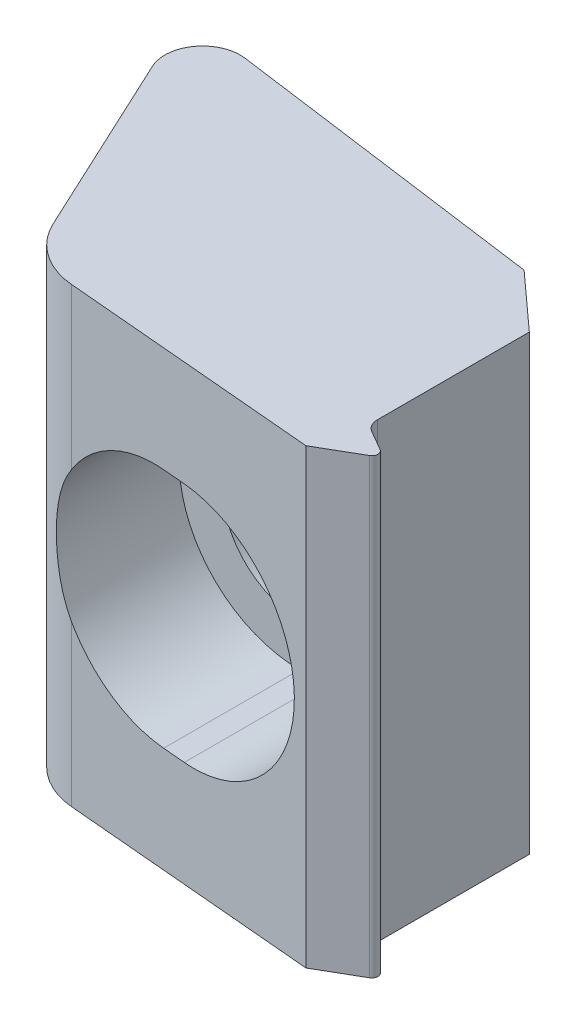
ISO-10303-21;
HEADER;
FILE_DESCRIPTION(('STEP AP214'),'2;1');
FILE_NAME('part.step','',(''),(''),'','','');
FILE_SCHEMA(('AUTOMOTIVE_DESIGN { 1 0 10303 214 1 1 1 1 }'));
ENDSEC;
DATA;
#1=APPLICATION_CONTEXT('core data for automotive mechanical design processes');
#2=APPLICATION_PROTOCOL_DEFINITION('international standard','automotive_design',2000,#1);
#3=PRODUCT_CONTEXT('',#1,'mechanical');
#4=PRODUCT('Part','Part','',(#3));
#5=PRODUCT_RELATED_PRODUCT_CATEGORY('part','',(#4));
#6=PRODUCT_DEFINITION_FORMATION('','',#4);
#7=PRODUCT_DEFINITION_CONTEXT('part definition',#1,'design');
#8=PRODUCT_DEFINITION('design','',#6,#7);
#9=PRODUCT_DEFINITION_SHAPE('','',#8);
#10=(LENGTH_UNIT() NAMED_UNIT(*) SI_UNIT(.MILLI.,.METRE.));
#11=(NAMED_UNIT(*) PLANE_ANGLE_UNIT() SI_UNIT($,.RADIAN.));
#12=(NAMED_UNIT(*) SI_UNIT($,.STERADIAN.) SOLID_ANGLE_UNIT());
#13=UNCERTAINTY_MEASURE_WITH_UNIT(LENGTH_MEASURE(1.E-05),#10,'distance_accuracy_value','');
#14=(GEOMETRIC_REPRESENTATION_CONTEXT(3) GLOBAL_UNCERTAINTY_ASSIGNED_CONTEXT((#13)) GLOBAL_UNIT_ASSIGNED_CONTEXT((#10,
#11,#12)) REPRESENTATION_CONTEXT('',''));
#15=CARTESIAN_POINT('',(0.,0.,0.));
#16=DIRECTION('',(0.,0.,1.));
#17=DIRECTION('',(1.,0.,0.));
#18=AXIS2_PLACEMENT_3D('',#15,#16,#17);
#19=CARTESIAN_POINT('',(14.6305142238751,19.05,23.7387920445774));
#20=DIRECTION('',(-0.50022485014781,0.,-0.865895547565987));
#21=DIRECTION('',(-0.865895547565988,0.,0.50022485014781));
#22=AXIS2_PLACEMENT_3D('',#19,#20,#21);
#23=PLANE('',#22);
#24=DIRECTION('',(0.865895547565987,0.,-0.50022485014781));
#25=VECTOR('',#24,1.);
#26=CARTESIAN_POINT('',(14.6305142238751,-19.05,23.7387920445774));
#27=LINE('',#26,#25);
#28=CARTESIAN_POINT('',(11.223932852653,-19.05,25.70676227));
#29=VERTEX_POINT('',#28);
#30=CARTESIAN_POINT('',(14.6305142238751,-19.05,23.7387920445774));
#31=VERTEX_POINT('',#30);
#32=EDGE_CURVE('E221',#29,#31,#27,.T.);
#33=ORIENTED_EDGE('',*,*,#32,.T.);
#34=DIRECTION('',(0.,-1.,0.));
#35=VECTOR('',#34,1.);
#36=CARTESIAN_POINT('',(14.6305142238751,19.05,23.7387920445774));
#37=LINE('',#36,#35);
#38=CARTESIAN_POINT('',(14.6305142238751,19.05,23.7387920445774));
#39=VERTEX_POINT('',#38);
#40=EDGE_CURVE('E276',#39,#31,#37,.T.);
#41=ORIENTED_EDGE('',*,*,#40,.F.);
#42=DIRECTION('',(0.865895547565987,0.,-0.50022485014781));
#43=VECTOR('',#42,1.);
#44=CARTESIAN_POINT('',(14.6305142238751,19.05,23.7387920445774));
#45=LINE('',#44,#43);
#46=CARTESIAN_POINT('',(11.223932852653,19.05,25.70676227));
#47=VERTEX_POINT('',#46);
#48=EDGE_CURVE('E303',#47,#39,#45,.T.);
#49=ORIENTED_EDGE('',*,*,#48,.F.);
#50=DIRECTION('',(0.,-1.,0.));
#51=VECTOR('',#50,1.);
#52=CARTESIAN_POINT('',(11.223932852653,19.05,25.70676227));
#53=LINE('',#52,#51);
#54=EDGE_CURVE('E278',#47,#29,#53,.T.);
#55=ORIENTED_EDGE('',*,*,#54,.T.);
#56=EDGE_LOOP('',(#33,#41,#49,#55));
#57=FACE_BOUND('',#56,.T.);
#58=ADVANCED_FACE('F14',(#57),#23,.F.);
#59=CARTESIAN_POINT('',(14.3764,19.05,23.2989171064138));
#60=DIRECTION('',(0.,-1.,0.));
#61=DIRECTION('',(1.,0.,0.));
#62=AXIS2_PLACEMENT_3D('',#59,#60,#61);
#63=CYLINDRICAL_SURFACE('',#62,0.508);
#64=CARTESIAN_POINT('',(14.3764,-19.05,23.2989171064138));
#65=DIRECTION('',(0.,1.,0.));
#66=DIRECTION('',(1.,0.,0.));
#67=AXIS2_PLACEMENT_3D('',#64,#65,#66);
#68=CIRCLE('',#67,0.508);
#69=CARTESIAN_POINT('',(14.6304493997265,-19.05,22.859004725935));
#70=VERTEX_POINT('',#69);
#71=EDGE_CURVE('E280',#31,#70,#68,.T.);
#72=ORIENTED_EDGE('',*,*,#71,.T.);
#73=DIRECTION('',(0.,-1.,0.));
#74=VECTOR('',#73,1.);
#75=CARTESIAN_POINT('',(14.6304493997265,19.05,22.859004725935));
#76=LINE('',#75,#74);
#77=CARTESIAN_POINT('',(14.6304493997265,19.05,22.859004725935));
#78=VERTEX_POINT('',#77);
#79=EDGE_CURVE('E352',#78,#70,#76,.T.);
#80=ORIENTED_EDGE('',*,*,#79,.F.);
#81=CARTESIAN_POINT('',(14.3764,19.05,23.2989171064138));
#82=DIRECTION('',(0.,1.,0.));
#83=DIRECTION('',(1.,0.,0.));
#84=AXIS2_PLACEMENT_3D('',#81,#82,#83);
#85=CIRCLE('',#84,0.508);
#86=EDGE_CURVE('E306',#39,#78,#85,.T.);
#87=ORIENTED_EDGE('',*,*,#86,.F.);
#88=ORIENTED_EDGE('',*,*,#40,.T.);
#89=EDGE_LOOP('',(#72,#80,#87,#88));
#90=FACE_BOUND('',#89,.T.);
#91=ADVANCED_FACE('F262',(#90),#63,.T.);
#92=CARTESIAN_POINT('',(12.9789493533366,19.05,21.9052634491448));
#93=DIRECTION('',(-0.500097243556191,0.,0.865969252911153));
#94=DIRECTION('',(0.865969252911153,0.,0.500097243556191));
#95=AXIS2_PLACEMENT_3D('',#92,#93,#94);
#96=PLANE('',#95);
#97=DIRECTION('',(-0.865969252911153,0.,-0.500097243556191));
#98=VECTOR('',#97,1.);
#99=CARTESIAN_POINT('',(12.9789493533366,-19.05,21.9052634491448));
#100=LINE('',#99,#98);
#101=CARTESIAN_POINT('',(12.9789493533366,-19.05,21.9052634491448));
#102=VERTEX_POINT('',#101);
#103=EDGE_CURVE('E281',#70,#102,#100,.T.);
#104=ORIENTED_EDGE('',*,*,#103,.T.);
#105=DIRECTION('',(0.,-1.,0.));
#106=VECTOR('',#105,1.);
#107=CARTESIAN_POINT('',(12.9789493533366,19.05,21.9052634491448));
#108=LINE('',#107,#106);
#109=CARTESIAN_POINT('',(12.9789493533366,19.05,21.9052634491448));
#110=VERTEX_POINT('',#109);
#111=EDGE_CURVE('E349',#110,#102,#108,.T.);
#112=ORIENTED_EDGE('',*,*,#111,.F.);
#113=DIRECTION('',(-0.865969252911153,0.,-0.500097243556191));
#114=VECTOR('',#113,1.);
#115=CARTESIAN_POINT('',(12.9789493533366,19.05,21.9052634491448));
#116=LINE('',#115,#114);
#117=EDGE_CURVE('E308',#78,#110,#116,.T.);
#118=ORIENTED_EDGE('',*,*,#117,.F.);
#119=ORIENTED_EDGE('',*,*,#79,.T.);
#120=EDGE_LOOP('',(#104,#112,#118,#119));
#121=FACE_BOUND('',#120,.T.);
#122=ADVANCED_FACE('F268',(#121),#96,.F.);
#123=CARTESIAN_POINT('',(13.614072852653,19.05,20.8054824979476));
#124=DIRECTION('',(0.,-1.,0.));
#125=DIRECTION('',(1.,0.,0.));
#126=AXIS2_PLACEMENT_3D('',#123,#124,#125);
#127=CYLINDRICAL_SURFACE('',#126,1.27);
#128=CARTESIAN_POINT('',(13.614072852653,-19.05,20.8054824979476));
#129=DIRECTION('',(0.,-1.,0.));
#130=DIRECTION('',(-1.,0.,0.));
#131=AXIS2_PLACEMENT_3D('',#128,#129,#130);
#132=CIRCLE('',#131,1.27);
#133=CARTESIAN_POINT('',(12.344072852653,-19.05,20.8054824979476));
#134=VERTEX_POINT('',#133);
#135=EDGE_CURVE('E284',#102,#134,#132,.T.);
#136=ORIENTED_EDGE('',*,*,#135,.T.);
#137=DIRECTION('',(0.,-1.,0.));
#138=VECTOR('',#137,1.);
#139=CARTESIAN_POINT('',(12.344072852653,19.05,20.8054824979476));
#140=LINE('',#139,#138);
#141=CARTESIAN_POINT('',(12.344072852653,19.05,20.8054824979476));
#142=VERTEX_POINT('',#141);
#143=EDGE_CURVE('E346',#142,#134,#140,.T.);
#144=ORIENTED_EDGE('',*,*,#143,.F.);
#145=CARTESIAN_POINT('',(13.614072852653,19.05,20.8054824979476));
#146=DIRECTION('',(0.,-1.,0.));
#147=DIRECTION('',(-1.,0.,0.));
#148=AXIS2_PLACEMENT_3D('',#145,#146,#147);
#149=CIRCLE('',#148,1.27);
#150=EDGE_CURVE('E310',#110,#142,#149,.T.);
#151=ORIENTED_EDGE('',*,*,#150,.F.);
#152=ORIENTED_EDGE('',*,*,#111,.T.);
#153=EDGE_LOOP('',(#136,#144,#151,#152));
#154=FACE_BOUND('',#153,.T.);
#155=ADVANCED_FACE('F399',(#154),#127,.F.);
#156=CARTESIAN_POINT('',(12.344072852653,19.05,8.00550227));
#157=DIRECTION('',(-1.,0.,0.));
#158=DIRECTION('',(0.,-1.,0.));
#159=AXIS2_PLACEMENT_3D('',#156,#157,#158);
#160=PLANE('',#159);
#161=DIRECTION('',(0.,0.,-1.));
#162=VECTOR('',#161,1.);
#163=CARTESIAN_POINT('',(12.344072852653,-19.05,8.00550227));
#164=LINE('',#163,#162);
#165=CARTESIAN_POINT('',(12.344072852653,-19.05,8.00550227));
#166=VERTEX_POINT('',#165);
#167=EDGE_CURVE('E288',#134,#166,#164,.T.);
#168=ORIENTED_EDGE('',*,*,#167,.T.);
#169=DIRECTION('',(0.,-1.,0.));
#170=VECTOR('',#169,1.);
#171=CARTESIAN_POINT('',(12.344072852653,19.05,8.00550227));
#172=LINE('',#171,#170);
#173=CARTESIAN_POINT('',(12.344072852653,19.05,8.00550227));
#174=VERTEX_POINT('',#173);
#175=EDGE_CURVE('E343',#174,#166,#172,.T.);
#176=ORIENTED_EDGE('',*,*,#175,.F.);
#177=DIRECTION('',(0.,0.,-1.));
#178=VECTOR('',#177,1.);
#179=CARTESIAN_POINT('',(12.344072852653,19.05,8.00550227));
#180=LINE('',#179,#178);
#181=EDGE_CURVE('E312',#142,#174,#180,.T.);
#182=ORIENTED_EDGE('',*,*,#181,.F.);
#183=ORIENTED_EDGE('',*,*,#143,.T.);
#184=EDGE_LOOP('',(#168,#176,#182,#183));
#185=FACE_BOUND('',#184,.T.);
#186=ADVANCED_FACE('F395',(#185),#160,.F.);
#187=CARTESIAN_POINT('',(7.604432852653,19.05,3.70782227));
#188=DIRECTION('',(-0.671723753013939,0.,0.740801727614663));
#189=DIRECTION('',(0.740801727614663,0.,0.671723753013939));
#190=AXIS2_PLACEMENT_3D('',#187,#188,#189);
#191=PLANE('',#190);
#192=DIRECTION('',(-0.740801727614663,0.,-0.671723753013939));
#193=VECTOR('',#192,1.);
#194=CARTESIAN_POINT('',(7.604432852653,-19.05,3.70782227));
#195=LINE('',#194,#193);
#196=CARTESIAN_POINT('',(7.604432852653,-19.05,3.70782227));
#197=VERTEX_POINT('',#196);
#198=EDGE_CURVE('E290',#166,#197,#195,.T.);
#199=ORIENTED_EDGE('',*,*,#198,.T.);
#200=DIRECTION('',(0.,-1.,0.));
#201=VECTOR('',#200,1.);
#202=CARTESIAN_POINT('',(7.604432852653,19.05,3.70782227));
#203=LINE('',#202,#201);
#204=CARTESIAN_POINT('',(7.604432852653,19.05,3.70782227));
#205=VERTEX_POINT('',#204);
#206=EDGE_CURVE('E340',#205,#197,#203,.T.);
#207=ORIENTED_EDGE('',*,*,#206,.F.);
#208=DIRECTION('',(-0.740801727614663,0.,-0.671723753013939));
#209=VECTOR('',#208,1.);
#210=CARTESIAN_POINT('',(7.604432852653,19.05,3.70782227));
#211=LINE('',#210,#209);
#212=EDGE_CURVE('E314',#174,#205,#211,.T.);
#213=ORIENTED_EDGE('',*,*,#212,.F.);
#214=ORIENTED_EDGE('',*,*,#175,.T.);
#215=EDGE_LOOP('',(#199,#207,#213,#214));
#216=FACE_BOUND('',#215,.T.);
#217=ADVANCED_FACE('F390',(#216),#191,.F.);
#218=CARTESIAN_POINT('',(-19.612114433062,19.05,2.11940187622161E-09));
#219=DIRECTION('',(-0.134987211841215,0.,0.990847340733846));
#220=DIRECTION('',(0.990847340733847,0.,0.134987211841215));
#221=AXIS2_PLACEMENT_3D('',#218,#219,#220);
#222=PLANE('',#221);
#223=DIRECTION('',(0.990847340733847,0.,0.134987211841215));
#224=VECTOR('',#223,1.);
#225=CARTESIAN_POINT('',(-19.612114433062,-6.5405,2.11940187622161E-09));
#226=LINE('',#225,#224);
#227=CARTESIAN_POINT('',(-1.905,-6.5405,2.4123130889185));
#228=VERTEX_POINT('',#227);
#229=CARTESIAN_POINT('',(0.,-6.5405,2.67183908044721));
#230=VERTEX_POINT('',#229);
#231=EDGE_CURVE('E183',#228,#230,#226,.T.);
#232=ORIENTED_EDGE('',*,*,#231,.T.);
#233=CARTESIAN_POINT('',(0.,0.,2.67183908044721));
#234=DIRECTION('',(-0.134987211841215,0.,0.990847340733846));
#235=DIRECTION('',(0.990847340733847,0.,0.134987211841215));
#236=AXIS2_PLACEMENT_3D('',#233,#234,#235);
#237=ELLIPSE('',#236,6.60091593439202,6.5405);
#238=CARTESIAN_POINT('',(0.,6.5405,2.67183908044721));
#239=VERTEX_POINT('',#238);
#240=EDGE_CURVE('E186',#230,#239,#237,.T.);
#241=ORIENTED_EDGE('',*,*,#240,.T.);
#242=DIRECTION('',(-0.990847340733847,0.,-0.134987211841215));
#243=VECTOR('',#242,1.);
#244=CARTESIAN_POINT('',(-19.612114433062,6.5405,2.11940187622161E-09));
#245=LINE('',#244,#243);
#246=CARTESIAN_POINT('',(-1.905,6.5405,2.4123130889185));
#247=VERTEX_POINT('',#246);
#248=EDGE_CURVE('E178',#239,#247,#245,.T.);
#249=ORIENTED_EDGE('',*,*,#248,.T.);
#250=CARTESIAN_POINT('',(-1.905,0.,2.4123130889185));
#251=DIRECTION('',(-0.134987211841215,0.,0.990847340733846));
#252=DIRECTION('',(0.990847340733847,0.,0.134987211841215));
#253=AXIS2_PLACEMENT_3D('',#250,#251,#252);
#254=ELLIPSE('',#253,6.60091593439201,6.5405);
#255=EDGE_CURVE('E158',#247,#228,#254,.T.);
#256=ORIENTED_EDGE('',*,*,#255,.T.);
#257=EDGE_LOOP('',(#232,#241,#249,#256));
#258=FACE_BOUND('',#257,.T.);
#259=DIRECTION('',(-0.990847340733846,0.,-0.134987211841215));
#260=VECTOR('',#259,1.);
#261=CARTESIAN_POINT('',(-19.612114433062,-19.05,2.11940187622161E-09));
#262=LINE('',#261,#260);
#263=CARTESIAN_POINT('',(-19.612114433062,-19.05,2.11940187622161E-09));
#264=VERTEX_POINT('',#263);
#265=EDGE_CURVE('E292',#197,#264,#262,.T.);
#266=ORIENTED_EDGE('',*,*,#265,.T.);
#267=DIRECTION('',(0.,-1.,0.));
#268=VECTOR('',#267,1.);
#269=CARTESIAN_POINT('',(-19.612114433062,19.05,2.11940187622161E-09));
#270=LINE('',#269,#268);
#271=CARTESIAN_POINT('',(-19.612114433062,19.05,2.11940187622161E-09));
#272=VERTEX_POINT('',#271);
#273=EDGE_CURVE('E337',#272,#264,#270,.T.);
#274=ORIENTED_EDGE('',*,*,#273,.F.);
#275=DIRECTION('',(-0.990847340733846,0.,-0.134987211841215));
#276=VECTOR('',#275,1.);
#277=CARTESIAN_POINT('',(-19.612114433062,19.05,2.11940187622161E-09));
#278=LINE('',#277,#276);
#279=EDGE_CURVE('E316',#205,#272,#278,.T.);
#280=ORIENTED_EDGE('',*,*,#279,.F.);
#281=ORIENTED_EDGE('',*,*,#206,.T.);
#282=EDGE_LOOP('',(#266,#274,#280,#281));
#283=FACE_BOUND('',#282,.T.);
#284=ADVANCED_FACE('F384',(#258,#283),#222,.F.);
#285=CARTESIAN_POINT('',(-20.0406988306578,19.05,3.14594030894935));
#286=DIRECTION('',(0.,-1.,0.));
#287=DIRECTION('',(1.,0.,0.));
#288=AXIS2_PLACEMENT_3D('',#285,#286,#287);
#289=CYLINDRICAL_SURFACE('',#288,3.175);
#290=CARTESIAN_POINT('',(-20.0406988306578,-19.05,3.14594030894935));
#291=DIRECTION('',(0.,1.,0.));
#292=DIRECTION('',(1.,0.,0.));
#293=AXIS2_PLACEMENT_3D('',#290,#291,#292);
#294=CIRCLE('',#293,3.175);
#295=CARTESIAN_POINT('',(-22.918160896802,-19.05,4.4878930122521));
#296=VERTEX_POINT('',#295);
#297=EDGE_CURVE('E294',#264,#296,#294,.T.);
#298=ORIENTED_EDGE('',*,*,#297,.T.);
#299=DIRECTION('',(0.,-1.,0.));
#300=VECTOR('',#299,1.);
#301=CARTESIAN_POINT('',(-22.918160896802,19.05,4.4878930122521));
#302=LINE('',#301,#300);
#303=CARTESIAN_POINT('',(-22.918160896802,19.05,4.4878930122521));
#304=VERTEX_POINT('',#303);
#305=EDGE_CURVE('E334',#304,#296,#302,.T.);
#306=ORIENTED_EDGE('',*,*,#305,.F.);
#307=CARTESIAN_POINT('',(-20.0406988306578,19.05,3.14594030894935));
#308=DIRECTION('',(0.,1.,0.));
#309=DIRECTION('',(1.,0.,0.));
#310=AXIS2_PLACEMENT_3D('',#307,#308,#309);
#311=CIRCLE('',#310,3.175);
#312=EDGE_CURVE('E318',#272,#304,#311,.T.);
#313=ORIENTED_EDGE('',*,*,#312,.F.);
#314=ORIENTED_EDGE('',*,*,#273,.T.);
#315=EDGE_LOOP('',(#298,#306,#313,#314));
#316=FACE_BOUND('',#315,.T.);
#317=ADVANCED_FACE('F380',(#316),#289,.T.);
#318=CARTESIAN_POINT('',(-15.6035579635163,19.05,20.1721212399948));
#319=DIRECTION('',(0.906287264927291,0.,-0.422662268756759));
#320=DIRECTION('',(-0.422662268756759,0.,-0.906287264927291));
#321=AXIS2_PLACEMENT_3D('',#318,#319,#320);
#322=PLANE('',#321);
#323=DIRECTION('',(0.422662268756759,0.,0.906287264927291));
#324=VECTOR('',#323,1.);
#325=CARTESIAN_POINT('',(-15.6035579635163,-19.05,20.1721212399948));
#326=LINE('',#325,#324);
#327=CARTESIAN_POINT('',(-15.6035579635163,-19.05,20.1721212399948));
#328=VERTEX_POINT('',#327);
#329=EDGE_CURVE('E296',#296,#328,#326,.T.);
#330=ORIENTED_EDGE('',*,*,#329,.T.);
#331=DIRECTION('',(0.,-1.,0.));
#332=VECTOR('',#331,1.);
#333=CARTESIAN_POINT('',(-15.6035579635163,19.05,20.1721212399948));
#334=LINE('',#333,#332);
#335=CARTESIAN_POINT('',(-15.6035579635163,19.05,20.1721212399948));
#336=VERTEX_POINT('',#335);
#337=EDGE_CURVE('E331',#336,#328,#334,.T.);
#338=ORIENTED_EDGE('',*,*,#337,.F.);
#339=DIRECTION('',(0.422662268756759,0.,0.906287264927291));
#340=VECTOR('',#339,1.);
#341=CARTESIAN_POINT('',(-15.6035579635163,19.05,20.1721212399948));
#342=LINE('',#341,#340);
#343=EDGE_CURVE('E320',#304,#336,#342,.T.);
#344=ORIENTED_EDGE('',*,*,#343,.F.);
#345=ORIENTED_EDGE('',*,*,#305,.T.);
#346=EDGE_LOOP('',(#330,#338,#344,#345));
#347=FACE_BOUND('',#346,.T.);
#348=ADVANCED_FACE('F258',(#347),#322,.F.);
#349=CARTESIAN_POINT('',(-9.84863383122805,19.05,17.4882158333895));
#350=DIRECTION('',(0.,-1.,0.));
#351=DIRECTION('',(1.,0.,0.));
#352=AXIS2_PLACEMENT_3D('',#349,#350,#351);
#353=CYLINDRICAL_SURFACE('',#352,6.35);
#354=DIRECTION('',(0.,-1.,0.));
#355=VECTOR('',#354,1.);
#356=CARTESIAN_POINT('',(-10.402270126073,19.05,23.814034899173));
#357=LINE('',#356,#355);
#358=CARTESIAN_POINT('',(-10.402270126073,-5.56973970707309,23.814034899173));
#359=VERTEX_POINT('',#358);
#360=CARTESIAN_POINT('',(-10.402270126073,-19.05,23.814034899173));
#361=VERTEX_POINT('',#360);
#362=EDGE_CURVE('E327',#359,#361,#357,.T.);
#363=ORIENTED_EDGE('',*,*,#362,.F.);
#364=CARTESIAN_POINT('',(-10.402270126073,-5.56973970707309,23.814034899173));
#365=CARTESIAN_POINT('',(-10.4759075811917,-5.45739721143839,23.8075876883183));
#366=CARTESIAN_POINT('',(-10.5472768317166,-5.34365579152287,23.8000485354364));
#367=CARTESIAN_POINT('',(-10.6853939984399,-5.11353987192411,23.783227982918));
#368=CARTESIAN_POINT('',(-10.7521423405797,-4.99716561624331,23.7739467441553));
#369=CARTESIAN_POINT('',(-10.9452888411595,-4.64441798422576,23.7441592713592));
#370=CARTESIAN_POINT('',(-11.0646567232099,-4.40431555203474,23.7217025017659));
#371=CARTESIAN_POINT('',(-11.2842510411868,-3.91501732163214,23.6748259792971));
#372=CARTESIAN_POINT('',(-11.3844291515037,-3.66580040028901,23.6504014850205));
#373=CARTESIAN_POINT('',(-11.5647863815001,-3.16009359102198,23.6026272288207));
#374=CARTESIAN_POINT('',(-11.6449634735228,-2.90360296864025,23.579277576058));
#375=CARTESIAN_POINT('',(-11.7888391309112,-2.3698218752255,23.5350421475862));
#376=CARTESIAN_POINT('',(-11.8513228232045,-2.09218420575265,23.514375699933));
#377=CARTESIAN_POINT('',(-11.952826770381,-1.53223050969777,23.4796897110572));
#378=CARTESIAN_POINT('',(-11.99184723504,-1.24991452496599,23.4656701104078));
#379=CARTESIAN_POINT('',(-12.0459916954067,-0.683200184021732,23.4459800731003));
#380=CARTESIAN_POINT('',(-12.0611575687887,-0.398806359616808,23.4402950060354));
#381=CARTESIAN_POINT('',(-12.0675573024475,0.170276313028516,23.4379128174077));
#382=CARTESIAN_POINT('',(-12.0587925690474,0.454965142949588,23.4412151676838));
#383=CARTESIAN_POINT('',(-12.0183134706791,1.01028503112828,23.4560813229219));
#384=CARTESIAN_POINT('',(-11.9875911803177,1.28099894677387,23.4672877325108));
#385=CARTESIAN_POINT('',(-11.904589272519,1.81874753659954,23.4963332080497));
#386=CARTESIAN_POINT('',(-11.8523081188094,2.08578194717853,23.5141727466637));
#387=CARTESIAN_POINT('',(-11.7265644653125,2.61465173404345,23.5545351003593));
#388=CARTESIAN_POINT('',(-11.6530866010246,2.87648319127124,23.5770613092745));
#389=CARTESIAN_POINT('',(-11.4854941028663,3.39315539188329,23.6242370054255));
#390=CARTESIAN_POINT('',(-11.3913844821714,3.6479978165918,23.6488859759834));
#391=CARTESIAN_POINT('',(-11.1660528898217,4.19023690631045,23.7012975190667));
#392=CARTESIAN_POINT('',(-11.0312848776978,4.47619138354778,23.7289148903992));
#393=CARTESIAN_POINT('',(-10.8096751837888,4.89460986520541,23.7655139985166));
#394=CARTESIAN_POINT('',(-10.7326759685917,5.03215702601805,23.7768974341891));
#395=CARTESIAN_POINT('',(-10.5722554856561,5.30369191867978,23.7973680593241));
#396=CARTESIAN_POINT('',(-10.4888320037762,5.43767840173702,23.8064544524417));
#397=CARTESIAN_POINT('',(-10.402270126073,5.5697397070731,23.814034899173));
#398=B_SPLINE_CURVE_WITH_KNOTS('',3,(#364,#365,#366,#367,#368,#369,#370,#371,#372,#373,#374,
#375,#376,#377,#378,#379,#380,#381,#382,#383,#384,#385,#386,#387,#388,#389,#390,#391,#392,#393,
#394,#395,#396,#397),.UNSPECIFIED.,.F.,.F.,(4,2,2,2,2,2,2,2,2,2,2,2,2,2,2,2,4),(0.,
0.403371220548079,0.806705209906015,1.61300011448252,2.42129956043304,3.22968091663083,
4.08461565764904,4.93954275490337,5.79296731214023,6.64634171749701,7.46341587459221,
8.28054826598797,9.09827445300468,9.91580216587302,10.8662239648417,11.340193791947,
11.8143277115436),.UNSPECIFIED.);
#399=CARTESIAN_POINT('',(-10.402270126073,5.56973970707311,23.814034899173));
#400=VERTEX_POINT('',#399);
#401=EDGE_CURVE('E205',#359,#400,#398,.T.);
#402=ORIENTED_EDGE('',*,*,#401,.T.);
#403=CARTESIAN_POINT('',(-10.402270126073,19.05,23.814034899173));
#404=VERTEX_POINT('',#403);
#405=EDGE_CURVE('E328',#404,#400,#357,.T.);
#406=ORIENTED_EDGE('',*,*,#405,.F.);
#407=CARTESIAN_POINT('',(-9.84863383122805,19.05,17.4882158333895));
#408=DIRECTION('',(0.,1.,0.));
#409=DIRECTION('',(1.,0.,0.));
#410=AXIS2_PLACEMENT_3D('',#407,#408,#409);
#411=CIRCLE('',#410,6.35);
#412=EDGE_CURVE('E322',#336,#404,#411,.T.);
#413=ORIENTED_EDGE('',*,*,#412,.F.);
#414=ORIENTED_EDGE('',*,*,#337,.T.);
#415=CARTESIAN_POINT('',(-9.84863383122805,-19.05,17.4882158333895));
#416=DIRECTION('',(0.,1.,0.));
#417=DIRECTION('',(1.,0.,0.));
#418=AXIS2_PLACEMENT_3D('',#415,#416,#417);
#419=CIRCLE('',#418,6.35);
#420=EDGE_CURVE('E298',#328,#361,#419,.T.);
#421=ORIENTED_EDGE('',*,*,#420,.T.);
#422=EDGE_LOOP('',(#363,#402,#406,#413,#414,#421));
#423=FACE_BOUND('',#422,.T.);
#424=ADVANCED_FACE('F223',(#423),#353,.T.);
#425=CARTESIAN_POINT('',(11.223932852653,19.05,25.70676227));
#426=DIRECTION('',(0.0871868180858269,0.,-0.996191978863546));
#427=DIRECTION('',(-0.996191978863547,0.,-0.0871868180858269));
#428=AXIS2_PLACEMENT_3D('',#425,#426,#427);
#429=PLANE('',#428);
#430=DIRECTION('',(-0.996191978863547,0.,-0.0871868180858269));
#431=VECTOR('',#430,1.);
#432=CARTESIAN_POINT('',(11.2239328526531,-10.16,25.70676227));
#433=LINE('',#432,#431);
#434=CARTESIAN_POINT('',(0.,-10.16,24.7244425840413));
#435=VERTEX_POINT('',#434);
#436=CARTESIAN_POINT('',(-1.905,-10.16,24.5577168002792));
#437=VERTEX_POINT('',#436);
#438=EDGE_CURVE('E17',#435,#437,#433,.T.);
#439=ORIENTED_EDGE('',*,*,#438,.T.);
#440=CARTESIAN_POINT('',(-1.905,0.,24.5577168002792));
#441=DIRECTION('',(0.0871868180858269,0.,-0.996191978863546));
#442=DIRECTION('',(0.996191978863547,0.,0.0871868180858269));
#443=AXIS2_PLACEMENT_3D('',#440,#441,#442);
#444=ELLIPSE('',#443,10.1988373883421,10.16);
#445=EDGE_CURVE('E9',#437,#359,#444,.T.);
#446=ORIENTED_EDGE('',*,*,#445,.T.);
#447=ORIENTED_EDGE('',*,*,#362,.T.);
#448=DIRECTION('',(0.996191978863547,0.,0.0871868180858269));
#449=VECTOR('',#448,1.);
#450=CARTESIAN_POINT('',(11.223932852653,-19.05,25.70676227));
#451=LINE('',#450,#449);
#452=EDGE_CURVE('E301',#361,#29,#451,.T.);
#453=ORIENTED_EDGE('',*,*,#452,.T.);
#454=ORIENTED_EDGE('',*,*,#54,.F.);
#455=DIRECTION('',(0.996191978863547,0.,0.0871868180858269));
#456=VECTOR('',#455,1.);
#457=CARTESIAN_POINT('',(11.223932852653,19.05,25.70676227));
#458=LINE('',#457,#456);
#459=EDGE_CURVE('E324',#404,#47,#458,.T.);
#460=ORIENTED_EDGE('',*,*,#459,.F.);
#461=ORIENTED_EDGE('',*,*,#405,.T.);
#462=CARTESIAN_POINT('',(-1.905,10.16,24.5577168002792));
#463=VERTEX_POINT('',#462);
#464=EDGE_CURVE('E23',#400,#463,#444,.T.);
#465=ORIENTED_EDGE('',*,*,#464,.T.);
#466=DIRECTION('',(0.996191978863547,0.,0.0871868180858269));
#467=VECTOR('',#466,1.);
#468=CARTESIAN_POINT('',(11.223932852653,10.16,25.70676227));
#469=LINE('',#468,#467);
#470=CARTESIAN_POINT('',(0.,10.16,24.7244425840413));
#471=VERTEX_POINT('',#470);
#472=EDGE_CURVE('E355',#463,#471,#469,.T.);
#473=ORIENTED_EDGE('',*,*,#472,.T.);
#474=CARTESIAN_POINT('',(0.,0.,24.7244425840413));
#475=DIRECTION('',(0.0871868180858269,0.,-0.996191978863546));
#476=DIRECTION('',(0.996191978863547,0.,0.0871868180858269));
#477=AXIS2_PLACEMENT_3D('',#474,#475,#476);
#478=ELLIPSE('',#477,10.1988373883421,10.16);
#479=EDGE_CURVE('E358',#471,#435,#478,.T.);
#480=ORIENTED_EDGE('',*,*,#479,.T.);
#481=EDGE_LOOP('',(#439,#446,#447,#453,#454,#460,#461,#465,#473,#480));
#482=FACE_BOUND('',#481,.T.);
#483=ADVANCED_FACE('F249',(#482),#429,.F.);
#484=CARTESIAN_POINT('',(-9.84863383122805,19.05,17.4882158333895));
#485=DIRECTION('',(0.,-1.,0.));
#486=DIRECTION('',(1.,0.,0.));
#487=AXIS2_PLACEMENT_3D('',#484,#485,#486);
#488=PLANE('',#487);
#489=ORIENTED_EDGE('',*,*,#48,.T.);
#490=ORIENTED_EDGE('',*,*,#86,.T.);
#491=ORIENTED_EDGE('',*,*,#117,.T.);
#492=ORIENTED_EDGE('',*,*,#150,.T.);
#493=ORIENTED_EDGE('',*,*,#181,.T.);
#494=ORIENTED_EDGE('',*,*,#212,.T.);
#495=ORIENTED_EDGE('',*,*,#279,.T.);
#496=ORIENTED_EDGE('',*,*,#312,.T.);
#497=ORIENTED_EDGE('',*,*,#343,.T.);
#498=ORIENTED_EDGE('',*,*,#412,.T.);
#499=ORIENTED_EDGE('',*,*,#459,.T.);
#500=EDGE_LOOP('',(#489,#490,#491,#492,#493,#494,#495,#496,#497,#498,#499));
#501=FACE_BOUND('',#500,.T.);
#502=ADVANCED_FACE('F246',(#501),#488,.F.);
#503=CARTESIAN_POINT('',(-9.84863383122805,-19.05,17.4882158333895));
#504=DIRECTION('',(0.,-1.,0.));
#505=DIRECTION('',(1.,0.,0.));
#506=AXIS2_PLACEMENT_3D('',#503,#504,#505);
#507=PLANE('',#506);
#508=ORIENTED_EDGE('',*,*,#32,.F.);
#509=ORIENTED_EDGE('',*,*,#452,.F.);
#510=ORIENTED_EDGE('',*,*,#420,.F.);
#511=ORIENTED_EDGE('',*,*,#329,.F.);
#512=ORIENTED_EDGE('',*,*,#297,.F.);
#513=ORIENTED_EDGE('',*,*,#265,.F.);
#514=ORIENTED_EDGE('',*,*,#198,.F.);
#515=ORIENTED_EDGE('',*,*,#167,.F.);
#516=ORIENTED_EDGE('',*,*,#135,.F.);
#517=ORIENTED_EDGE('',*,*,#103,.F.);
#518=ORIENTED_EDGE('',*,*,#71,.F.);
#519=EDGE_LOOP('',(#508,#509,#510,#511,#512,#513,#514,#515,#516,#517,#518));
#520=FACE_BOUND('',#519,.T.);
#521=ADVANCED_FACE('F242',(#520),#507,.T.);
#522=CARTESIAN_POINT('',(0.,0.,13.10074227));
#523=DIRECTION('',(0.,0.,1.));
#524=DIRECTION('',(0.,1.,0.));
#525=AXIS2_PLACEMENT_3D('',#522,#523,#524);
#526=CYLINDRICAL_SURFACE('',#525,10.16);
#527=DIRECTION('',(0.,0.,1.));
#528=VECTOR('',#527,1.);
#529=CARTESIAN_POINT('',(0.,10.16,13.10074227));
#530=LINE('',#529,#528);
#531=CARTESIAN_POINT('',(0.,10.16,13.10074227));
#532=VERTEX_POINT('',#531);
#533=EDGE_CURVE('E201',#532,#471,#530,.T.);
#534=ORIENTED_EDGE('',*,*,#533,.F.);
#535=CARTESIAN_POINT('',(0.,0.,13.10074227));
#536=DIRECTION('',(0.,0.,1.));
#537=DIRECTION('',(0.,1.,0.));
#538=AXIS2_PLACEMENT_3D('',#535,#536,#537);
#539=CIRCLE('',#538,10.16);
#540=CARTESIAN_POINT('',(0.,-10.16,13.10074227));
#541=VERTEX_POINT('',#540);
#542=EDGE_CURVE('E189',#541,#532,#539,.T.);
#543=ORIENTED_EDGE('',*,*,#542,.F.);
#544=DIRECTION('',(0.,0.,1.));
#545=VECTOR('',#544,1.);
#546=CARTESIAN_POINT('',(0.,-10.16,13.10074227));
#547=LINE('',#546,#545);
#548=EDGE_CURVE('E202',#541,#435,#547,.T.);
#549=ORIENTED_EDGE('',*,*,#548,.T.);
#550=ORIENTED_EDGE('',*,*,#479,.F.);
#551=EDGE_LOOP('',(#534,#543,#549,#550));
#552=FACE_BOUND('',#551,.T.);
#553=ADVANCED_FACE('F239',(#552),#526,.F.);
#554=CARTESIAN_POINT('',(0.,-10.16,13.10074227));
#555=DIRECTION('',(0.,-1.,0.));
#556=DIRECTION('',(1.,0.,0.));
#557=AXIS2_PLACEMENT_3D('',#554,#555,#556);
#558=PLANE('',#557);
#559=ORIENTED_EDGE('',*,*,#548,.F.);
#560=DIRECTION('',(1.,0.,0.));
#561=VECTOR('',#560,1.);
#562=CARTESIAN_POINT('',(0.,-10.16,13.10074227));
#563=LINE('',#562,#561);
#564=CARTESIAN_POINT('',(-1.905,-10.16,13.10074227));
#565=VERTEX_POINT('',#564);
#566=EDGE_CURVE('E198',#565,#541,#563,.T.);
#567=ORIENTED_EDGE('',*,*,#566,.F.);
#568=DIRECTION('',(0.,0.,1.));
#569=VECTOR('',#568,1.);
#570=CARTESIAN_POINT('',(-1.905,-10.16,13.10074227));
#571=LINE('',#570,#569);
#572=EDGE_CURVE('E206',#565,#437,#571,.T.);
#573=ORIENTED_EDGE('',*,*,#572,.T.);
#574=ORIENTED_EDGE('',*,*,#438,.F.);
#575=EDGE_LOOP('',(#559,#567,#573,#574));
#576=FACE_BOUND('',#575,.T.);
#577=ADVANCED_FACE('F233',(#576),#558,.F.);
#578=CARTESIAN_POINT('',(-1.905,0.,13.10074227));
#579=DIRECTION('',(0.,0.,1.));
#580=DIRECTION('',(0.,1.,0.));
#581=AXIS2_PLACEMENT_3D('',#578,#579,#580);
#582=CYLINDRICAL_SURFACE('',#581,10.16);
#583=ORIENTED_EDGE('',*,*,#572,.F.);
#584=CARTESIAN_POINT('',(-1.905,0.,13.10074227));
#585=DIRECTION('',(0.,0.,1.));
#586=DIRECTION('',(0.,1.,0.));
#587=AXIS2_PLACEMENT_3D('',#584,#585,#586);
#588=CIRCLE('',#587,10.16);
#589=CARTESIAN_POINT('',(-1.905,10.16,13.10074227));
#590=VERTEX_POINT('',#589);
#591=EDGE_CURVE('E195',#590,#565,#588,.T.);
#592=ORIENTED_EDGE('',*,*,#591,.F.);
#593=DIRECTION('',(0.,0.,1.));
#594=VECTOR('',#593,1.);
#595=CARTESIAN_POINT('',(-1.905,10.16,13.10074227));
#596=LINE('',#595,#594);
#597=EDGE_CURVE('E209',#590,#463,#596,.T.);
#598=ORIENTED_EDGE('',*,*,#597,.T.);
#599=ORIENTED_EDGE('',*,*,#464,.F.);
#600=ORIENTED_EDGE('',*,*,#401,.F.);
#601=ORIENTED_EDGE('',*,*,#445,.F.);
#602=EDGE_LOOP('',(#583,#592,#598,#599,#600,#601));
#603=FACE_BOUND('',#602,.T.);
#604=ADVANCED_FACE('F227',(#603),#582,.F.);
#605=CARTESIAN_POINT('',(-1.905,10.16,13.10074227));
#606=DIRECTION('',(0.,1.,0.));
#607=DIRECTION('',(-1.,0.,0.));
#608=AXIS2_PLACEMENT_3D('',#605,#606,#607);
#609=PLANE('',#608);
#610=ORIENTED_EDGE('',*,*,#597,.F.);
#611=DIRECTION('',(-1.,0.,0.));
#612=VECTOR('',#611,1.);
#613=CARTESIAN_POINT('',(-1.905,10.16,13.10074227));
#614=LINE('',#613,#612);
#615=EDGE_CURVE('E192',#532,#590,#614,.T.);
#616=ORIENTED_EDGE('',*,*,#615,.F.);
#617=ORIENTED_EDGE('',*,*,#533,.T.);
#618=ORIENTED_EDGE('',*,*,#472,.F.);
#619=EDGE_LOOP('',(#610,#616,#617,#618));
#620=FACE_BOUND('',#619,.T.);
#621=ADVANCED_FACE('F232',(#620),#609,.F.);
#622=CARTESIAN_POINT('',(0.,0.,13.10074227));
#623=DIRECTION('',(0.,0.,1.));
#624=DIRECTION('',(0.,1.,0.));
#625=AXIS2_PLACEMENT_3D('',#622,#623,#624);
#626=PLANE('',#625);
#627=CARTESIAN_POINT('',(0.,0.,13.10074227));
#628=DIRECTION('',(0.,0.,1.));
#629=DIRECTION('',(0.,1.,0.));
#630=AXIS2_PLACEMENT_3D('',#627,#628,#629);
#631=CIRCLE('',#630,6.5405);
#632=CARTESIAN_POINT('',(0.,-6.5405,13.10074227));
#633=VERTEX_POINT('',#632);
#634=CARTESIAN_POINT('',(0.,6.5405,13.10074227));
#635=VERTEX_POINT('',#634);
#636=EDGE_CURVE('E38',#633,#635,#631,.T.);
#637=ORIENTED_EDGE('',*,*,#636,.F.);
#638=DIRECTION('',(1.,0.,0.));
#639=VECTOR('',#638,1.);
#640=CARTESIAN_POINT('',(-1.905,-6.5405,13.10074227));
#641=LINE('',#640,#639);
#642=CARTESIAN_POINT('',(-1.905,-6.5405,13.10074227));
#643=VERTEX_POINT('',#642);
#644=EDGE_CURVE('E171',#643,#633,#641,.T.);
#645=ORIENTED_EDGE('',*,*,#644,.F.);
#646=CARTESIAN_POINT('',(-1.905,0.,13.10074227));
#647=DIRECTION('',(0.,0.,1.));
#648=DIRECTION('',(0.,1.,0.));
#649=AXIS2_PLACEMENT_3D('',#646,#647,#648);
#650=CIRCLE('',#649,6.5405);
#651=CARTESIAN_POINT('',(-1.905,6.5405,13.10074227));
#652=VERTEX_POINT('',#651);
#653=EDGE_CURVE('E155',#652,#643,#650,.T.);
#654=ORIENTED_EDGE('',*,*,#653,.F.);
#655=DIRECTION('',(-1.,0.,0.));
#656=VECTOR('',#655,1.);
#657=CARTESIAN_POINT('',(-1.905,6.5405,13.10074227));
#658=LINE('',#657,#656);
#659=EDGE_CURVE('E164',#635,#652,#658,.T.);
#660=ORIENTED_EDGE('',*,*,#659,.F.);
#661=EDGE_LOOP('',(#637,#645,#654,#660));
#662=FACE_BOUND('',#661,.T.);
#663=ORIENTED_EDGE('',*,*,#542,.T.);
#664=ORIENTED_EDGE('',*,*,#615,.T.);
#665=ORIENTED_EDGE('',*,*,#591,.T.);
#666=ORIENTED_EDGE('',*,*,#566,.T.);
#667=EDGE_LOOP('',(#663,#664,#665,#666));
#668=FACE_BOUND('',#667,.T.);
#669=ADVANCED_FACE('F168',(#662,#668),#626,.T.);
#670=CARTESIAN_POINT('',(0.,0.,-0.0290596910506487));
#671=DIRECTION('',(0.,0.,1.));
#672=DIRECTION('',(0.,1.,0.));
#673=AXIS2_PLACEMENT_3D('',#670,#671,#672);
#674=CYLINDRICAL_SURFACE('',#673,6.5405);
#675=DIRECTION('',(0.,0.,1.));
#676=VECTOR('',#675,1.);
#677=CARTESIAN_POINT('',(0.,-6.5405,-0.0290596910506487));
#678=LINE('',#677,#676);
#679=EDGE_CURVE('E176',#230,#633,#678,.T.);
#680=ORIENTED_EDGE('',*,*,#679,.T.);
#681=ORIENTED_EDGE('',*,*,#636,.T.);
#682=DIRECTION('',(0.,0.,1.));
#683=VECTOR('',#682,1.);
#684=CARTESIAN_POINT('',(0.,6.5405,-0.0290596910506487));
#685=LINE('',#684,#683);
#686=EDGE_CURVE('E161',#239,#635,#685,.T.);
#687=ORIENTED_EDGE('',*,*,#686,.F.);
#688=ORIENTED_EDGE('',*,*,#240,.F.);
#689=EDGE_LOOP('',(#680,#681,#687,#688));
#690=FACE_BOUND('',#689,.T.);
#691=ADVANCED_FACE('F527',(#690),#674,.F.);
#692=CARTESIAN_POINT('',(-1.905,-6.5405,-0.0290596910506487));
#693=DIRECTION('',(0.,-1.,0.));
#694=DIRECTION('',(1.,0.,0.));
#695=AXIS2_PLACEMENT_3D('',#692,#693,#694);
#696=PLANE('',#695);
#697=DIRECTION('',(0.,0.,1.));
#698=VECTOR('',#697,1.);
#699=CARTESIAN_POINT('',(-1.905,-6.5405,-0.0290596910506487));
#700=LINE('',#699,#698);
#701=EDGE_CURVE('E160',#228,#643,#700,.T.);
#702=ORIENTED_EDGE('',*,*,#701,.T.);
#703=ORIENTED_EDGE('',*,*,#644,.T.);
#704=ORIENTED_EDGE('',*,*,#679,.F.);
#705=ORIENTED_EDGE('',*,*,#231,.F.);
#706=EDGE_LOOP('',(#702,#703,#704,#705));
#707=FACE_BOUND('',#706,.T.);
#708=ADVANCED_FACE('F535',(#707),#696,.F.);
#709=CARTESIAN_POINT('',(-1.905,0.,-0.0290596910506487));
#710=DIRECTION('',(0.,0.,1.));
#711=DIRECTION('',(0.,1.,0.));
#712=AXIS2_PLACEMENT_3D('',#709,#710,#711);
#713=CYLINDRICAL_SURFACE('',#712,6.5405);
#714=DIRECTION('',(0.,0.,1.));
#715=VECTOR('',#714,1.);
#716=CARTESIAN_POINT('',(-1.905,6.5405,-0.0290596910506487));
#717=LINE('',#716,#715);
#718=EDGE_CURVE('E30',#247,#652,#717,.T.);
#719=ORIENTED_EDGE('',*,*,#718,.T.);
#720=ORIENTED_EDGE('',*,*,#653,.T.);
#721=ORIENTED_EDGE('',*,*,#701,.F.);
#722=ORIENTED_EDGE('',*,*,#255,.F.);
#723=EDGE_LOOP('',(#719,#720,#721,#722));
#724=FACE_BOUND('',#723,.T.);
#725=ADVANCED_FACE('F152',(#724),#713,.F.);
#726=CARTESIAN_POINT('',(-1.905,6.5405,-0.0290596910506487));
#727=DIRECTION('',(0.,1.,0.));
#728=DIRECTION('',(-1.,0.,0.));
#729=AXIS2_PLACEMENT_3D('',#726,#727,#728);
#730=PLANE('',#729);
#731=ORIENTED_EDGE('',*,*,#686,.T.);
#732=ORIENTED_EDGE('',*,*,#659,.T.);
#733=ORIENTED_EDGE('',*,*,#718,.F.);
#734=ORIENTED_EDGE('',*,*,#248,.F.);
#735=EDGE_LOOP('',(#731,#732,#733,#734));
#736=FACE_BOUND('',#735,.T.);
#737=ADVANCED_FACE('F165',(#736),#730,.F.);
#738=CLOSED_SHELL('',(#58,#91,#122,#155,#186,#217,#284,#317,#348,#424,#483,#502,#521,#553,#577,
#604,#621,#669,#691,#708,#725,#737));
#739=MANIFOLD_SOLID_BREP('B1',#738);
#740=ADVANCED_BREP_SHAPE_REPRESENTATION('',(#18,#739),#14);
#741=SHAPE_DEFINITION_REPRESENTATION(#9,#740);
ENDSEC;
END-ISO-10303-21;
